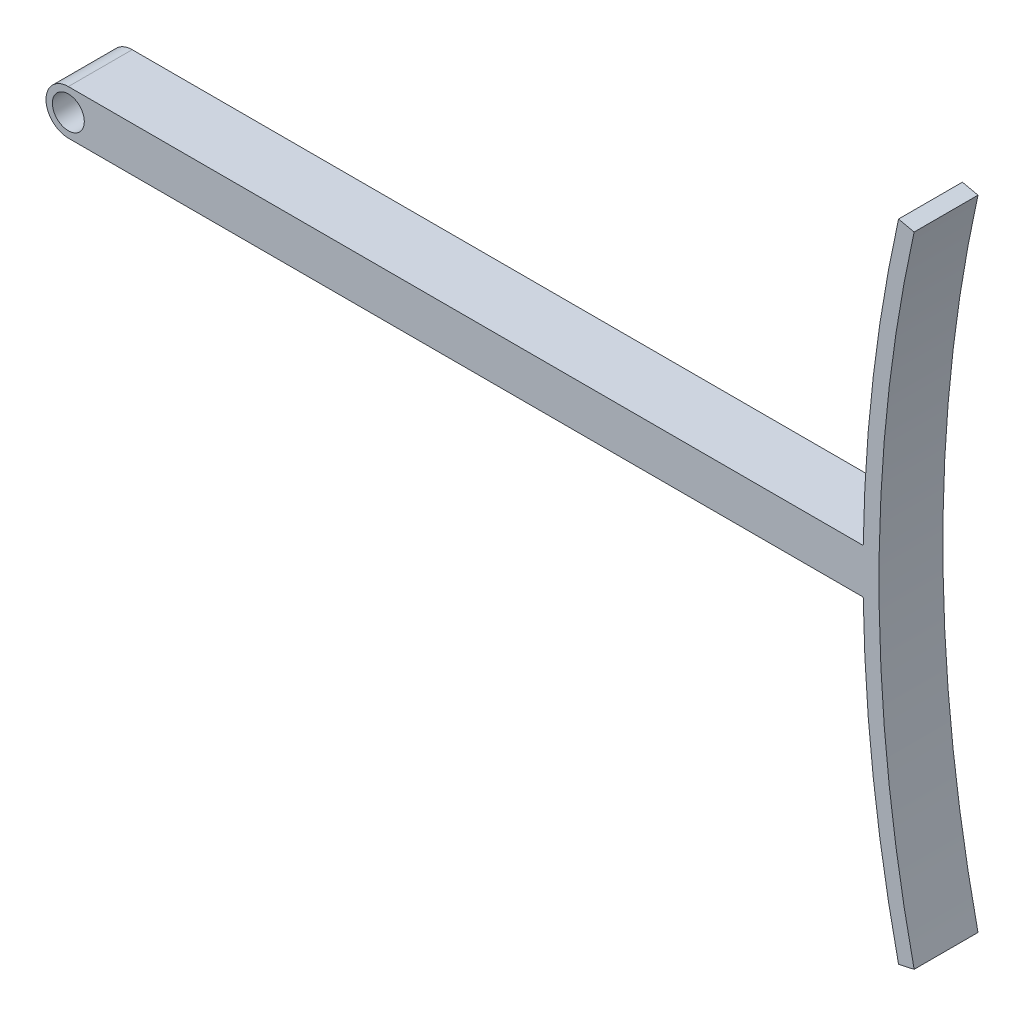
from build123d import *

# Parameters (mm, degrees)
ESQUISSE1_R      = 5
EXTRUSION1_DEPTH = 10


with BuildPart() as part:
    # Esquisse1 → Extrusion1 (new, symmetric)
    with BuildSketch(Plane.XY):
        with BuildLine():
            Line((0, -7), (248.962691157, -7))
            ThreePointArc((248.962691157, -7), (252.094368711, -54.326077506), (260.030690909, -101.086956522))
            Line((260.030690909, -101.086956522), (264.911113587, -100))
            ThreePointArc((264.911113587, -100), (253.91, 0), (264.911113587, 100))
            Line((264.911113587, 100), (260.030690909, 101.086956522))
            ThreePointArc((260.030690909, 101.086956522), (252.094368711, 54.326077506), (248.962691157, 7))
            Line((248.962691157, 7), (0, 7))
            ThreePointArc((0, 7), (-7, 0), (0, -7))
        make_face()
        Circle(ESQUISSE1_R, mode=Mode.SUBTRACT)
    extrude(amount=EXTRUSION1_DEPTH, both=True)


solid = part.part
